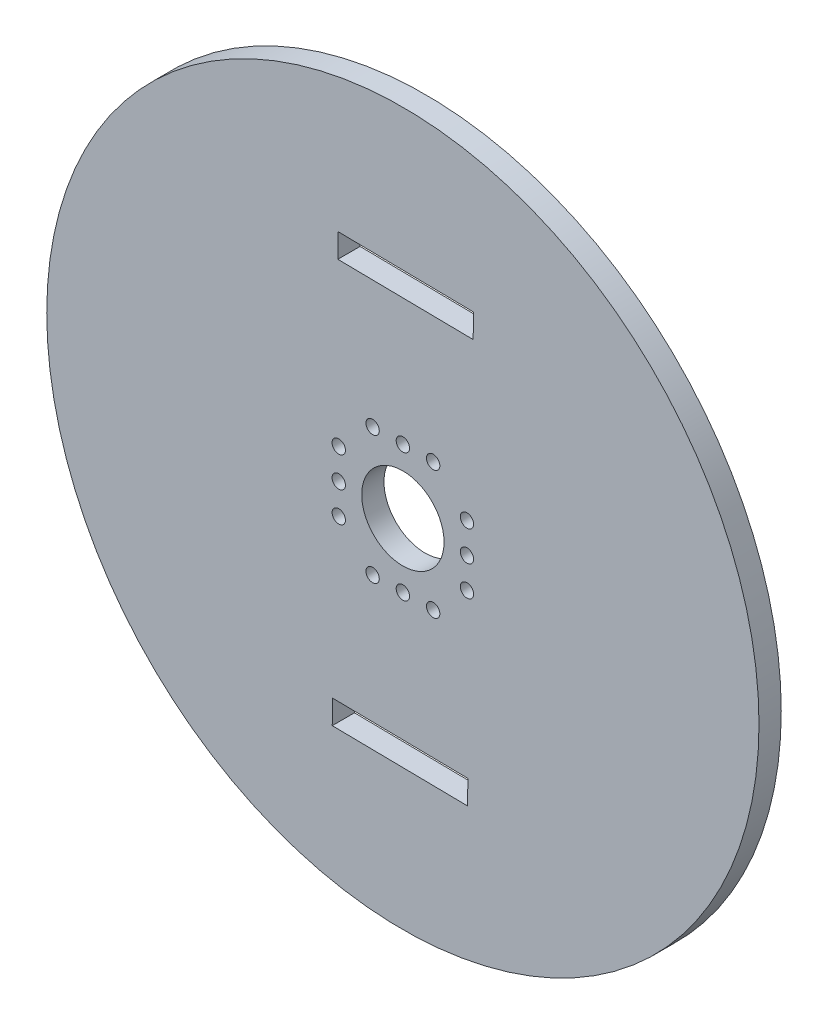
from build123d import *

# Parameters (mm, degrees)
SKETCH1_R           = 40
SKETCH1_R_2         = 10.4
SKETCH1_R_3         = 0.75
SKETCH1_R_4         = 4.625
BOSS_EXTRUDE1_DEPTH = 2.5
CUT_EXTRUDE1_DEPTH  = 10


with BuildPart() as part:
    # Sketch1 → Boss-Extrude1 (new body)
    # profile 1 of 2: a face of its own
    with BuildSketch(Plane.XY):
        Circle(SKETCH1_R)
        Circle(SKETCH1_R_2, mode=Mode.SUBTRACT)
    # profile 2 of 2: a face of its own
    with BuildSketch(Plane.XY):
        Circle(SKETCH1_R_2)
        with Locations((7.2, -3.4)):
            Circle(SKETCH1_R_3, mode=Mode.SUBTRACT)
        with Locations((7.2, 3.4)):
            Circle(SKETCH1_R_3, mode=Mode.SUBTRACT)
        with Locations((7.2, 0)):
            Circle(SKETCH1_R_3, mode=Mode.SUBTRACT)
        with Locations((3.4, -7.2)):
            Circle(SKETCH1_R_3, mode=Mode.SUBTRACT)
        with Locations((-3.4, -7.2)):
            Circle(SKETCH1_R_3, mode=Mode.SUBTRACT)
        with Locations((0, -7.2)):
            Circle(SKETCH1_R_3, mode=Mode.SUBTRACT)
        with Locations((-7.2, -3.4)):
            Circle(SKETCH1_R_3, mode=Mode.SUBTRACT)
        with Locations((-7.2, 0)):
            Circle(SKETCH1_R_3, mode=Mode.SUBTRACT)
        with Locations((-7.2, 3.4)):
            Circle(SKETCH1_R_3, mode=Mode.SUBTRACT)
        with Locations((-3.4, 7.2)):
            Circle(SKETCH1_R_3, mode=Mode.SUBTRACT)
        with Locations((0, 7.2)):
            Circle(SKETCH1_R_3, mode=Mode.SUBTRACT)
        with Locations((3.4, 7.2)):
            Circle(SKETCH1_R_3, mode=Mode.SUBTRACT)
        Circle(SKETCH1_R_4, mode=Mode.SUBTRACT)
    extrude(amount=BOSS_EXTRUDE1_DEPTH)

    # Sketch3 → Cut-Extrude1 (cut)
    with BuildSketch(Plane(origin=(0, 0, 0), x_dir=(-1, 0, 0), z_dir=(0, 0, -1))):
        Polygon((-7.301610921, -21.634044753), (7.896936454, -21.423907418), (7.934263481, -24.123649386), (-7.264283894, -24.333786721), align=None)
        Polygon((7.265373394, 24.254986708), (-7.93317398, 24.044849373), (-7.895846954, 21.345107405), (7.302700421, 21.555244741), align=None)
    extrude(amount=-CUT_EXTRUDE1_DEPTH, mode=Mode.SUBTRACT)


solid = part.part
